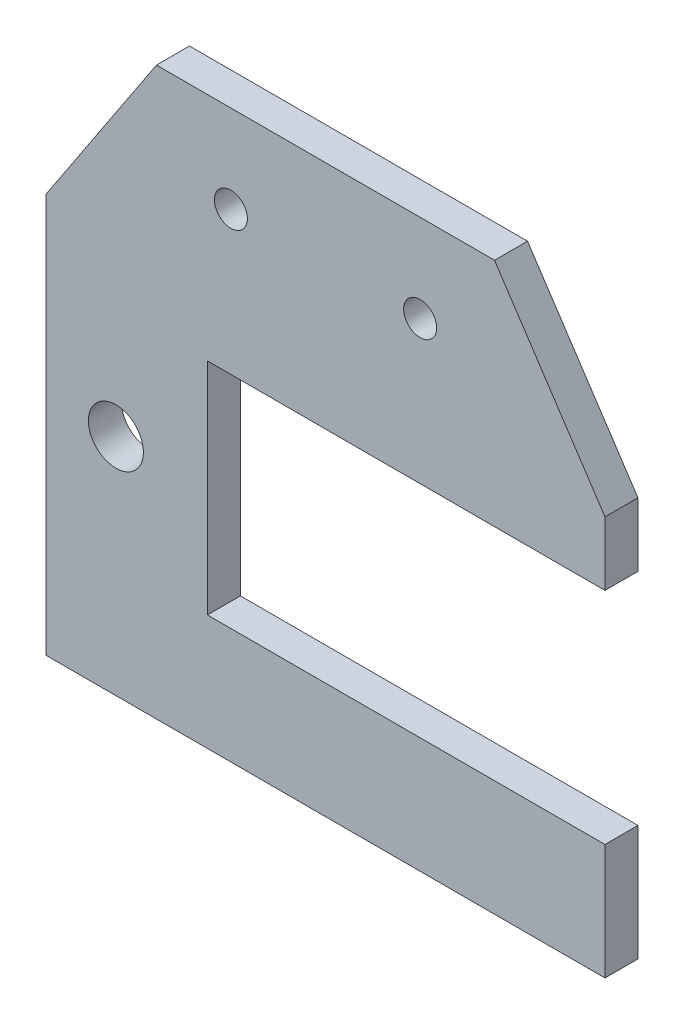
ISO-10303-21;
HEADER;
FILE_DESCRIPTION(('STEP AP214'),'2;1');
FILE_NAME('part.step','',(''),(''),'','','');
FILE_SCHEMA(('AUTOMOTIVE_DESIGN { 1 0 10303 214 1 1 1 1 }'));
ENDSEC;
DATA;
#1=APPLICATION_CONTEXT('core data for automotive mechanical design processes');
#2=APPLICATION_PROTOCOL_DEFINITION('international standard','automotive_design',2000,#1);
#3=PRODUCT_CONTEXT('',#1,'mechanical');
#4=PRODUCT('Part','Part','',(#3));
#5=PRODUCT_RELATED_PRODUCT_CATEGORY('part','',(#4));
#6=PRODUCT_DEFINITION_FORMATION('','',#4);
#7=PRODUCT_DEFINITION_CONTEXT('part definition',#1,'design');
#8=PRODUCT_DEFINITION('design','',#6,#7);
#9=PRODUCT_DEFINITION_SHAPE('','',#8);
#10=(LENGTH_UNIT() NAMED_UNIT(*) SI_UNIT(.MILLI.,.METRE.));
#11=(NAMED_UNIT(*) PLANE_ANGLE_UNIT() SI_UNIT($,.RADIAN.));
#12=(NAMED_UNIT(*) SI_UNIT($,.STERADIAN.) SOLID_ANGLE_UNIT());
#13=UNCERTAINTY_MEASURE_WITH_UNIT(LENGTH_MEASURE(1.E-05),#10,'distance_accuracy_value','');
#14=(GEOMETRIC_REPRESENTATION_CONTEXT(3) GLOBAL_UNCERTAINTY_ASSIGNED_CONTEXT((#13)) GLOBAL_UNIT_ASSIGNED_CONTEXT((#10,
#11,#12)) REPRESENTATION_CONTEXT('',''));
#15=CARTESIAN_POINT('',(0.,0.,0.));
#16=DIRECTION('',(0.,0.,1.));
#17=DIRECTION('',(1.,0.,0.));
#18=AXIS2_PLACEMENT_3D('',#15,#16,#17);
#19=CARTESIAN_POINT('',(0.,-1.81128409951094,3.));
#20=DIRECTION('',(0.,1.,0.));
#21=DIRECTION('',(-1.,0.,0.));
#22=AXIS2_PLACEMENT_3D('',#19,#20,#21);
#23=PLANE('',#22);
#24=DIRECTION('',(1.,0.,0.));
#25=VECTOR('',#24,1.);
#26=CARTESIAN_POINT('',(0.,-1.81128409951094,0.));
#27=LINE('',#26,#25);
#28=CARTESIAN_POINT('',(-10.7376947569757,-1.81128409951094,0.));
#29=VERTEX_POINT('',#28);
#30=CARTESIAN_POINT('',(25.4023052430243,-1.81128409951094,0.));
#31=VERTEX_POINT('',#30);
#32=EDGE_CURVE('E181',#29,#31,#27,.T.);
#33=ORIENTED_EDGE('',*,*,#32,.F.);
#34=DIRECTION('',(0.,0.,-1.));
#35=VECTOR('',#34,1.);
#36=CARTESIAN_POINT('',(-10.7376947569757,-1.81128409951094,3.));
#37=LINE('',#36,#35);
#38=CARTESIAN_POINT('',(-10.7376947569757,-1.81128409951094,3.));
#39=VERTEX_POINT('',#38);
#40=EDGE_CURVE('E11',#39,#29,#37,.T.);
#41=ORIENTED_EDGE('',*,*,#40,.F.);
#42=DIRECTION('',(1.,0.,0.));
#43=VECTOR('',#42,1.);
#44=CARTESIAN_POINT('',(0.,-1.81128409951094,3.));
#45=LINE('',#44,#43);
#46=CARTESIAN_POINT('',(25.4023052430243,-1.81128409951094,3.));
#47=VERTEX_POINT('',#46);
#48=EDGE_CURVE('E273',#39,#47,#45,.T.);
#49=ORIENTED_EDGE('',*,*,#48,.T.);
#50=DIRECTION('',(0.,0.,-1.));
#51=VECTOR('',#50,1.);
#52=CARTESIAN_POINT('',(25.4023052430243,-1.81128409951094,3.));
#53=LINE('',#52,#51);
#54=EDGE_CURVE('E60',#47,#31,#53,.T.);
#55=ORIENTED_EDGE('',*,*,#54,.T.);
#56=EDGE_LOOP('',(#33,#41,#49,#55));
#57=FACE_BOUND('',#56,.T.);
#58=ADVANCED_FACE('F43',(#57),#23,.T.);
#59=CARTESIAN_POINT('',(-10.7376947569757,0.,3.));
#60=DIRECTION('',(1.,0.,0.));
#61=DIRECTION('',(0.,1.,0.));
#62=AXIS2_PLACEMENT_3D('',#59,#60,#61);
#63=PLANE('',#62);
#64=DIRECTION('',(0.,-1.,0.));
#65=VECTOR('',#64,1.);
#66=CARTESIAN_POINT('',(-10.7376947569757,0.,0.));
#67=LINE('',#66,#65);
#68=CARTESIAN_POINT('',(-10.7376947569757,18.1887159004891,0.));
#69=VERTEX_POINT('',#68);
#70=EDGE_CURVE('E175',#69,#29,#67,.T.);
#71=ORIENTED_EDGE('',*,*,#70,.F.);
#72=DIRECTION('',(0.,0.,-1.));
#73=VECTOR('',#72,1.);
#74=CARTESIAN_POINT('',(-10.7376947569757,18.1887159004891,3.));
#75=LINE('',#74,#73);
#76=CARTESIAN_POINT('',(-10.7376947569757,18.1887159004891,3.));
#77=VERTEX_POINT('',#76);
#78=EDGE_CURVE('E52',#77,#69,#75,.T.);
#79=ORIENTED_EDGE('',*,*,#78,.F.);
#80=DIRECTION('',(0.,-1.,0.));
#81=VECTOR('',#80,1.);
#82=CARTESIAN_POINT('',(-10.7376947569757,0.,3.));
#83=LINE('',#82,#81);
#84=EDGE_CURVE('E275',#77,#39,#83,.T.);
#85=ORIENTED_EDGE('',*,*,#84,.T.);
#86=ORIENTED_EDGE('',*,*,#40,.T.);
#87=EDGE_LOOP('',(#71,#79,#85,#86));
#88=FACE_BOUND('',#87,.T.);
#89=ADVANCED_FACE('F180',(#88),#63,.T.);
#90=CARTESIAN_POINT('',(0.,18.1887159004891,3.));
#91=DIRECTION('',(0.,1.,0.));
#92=DIRECTION('',(-1.,0.,0.));
#93=AXIS2_PLACEMENT_3D('',#90,#91,#92);
#94=PLANE('',#93);
#95=DIRECTION('',(1.,0.,0.));
#96=VECTOR('',#95,1.);
#97=CARTESIAN_POINT('',(0.,18.1887159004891,0.));
#98=LINE('',#97,#96);
#99=CARTESIAN_POINT('',(25.4023052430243,18.1887159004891,0.));
#100=VERTEX_POINT('',#99);
#101=EDGE_CURVE('E164',#69,#100,#98,.T.);
#102=ORIENTED_EDGE('',*,*,#101,.T.);
#103=DIRECTION('',(0.,0.,-1.));
#104=VECTOR('',#103,1.);
#105=CARTESIAN_POINT('',(25.4023052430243,18.1887159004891,3.));
#106=LINE('',#105,#104);
#107=CARTESIAN_POINT('',(25.4023052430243,18.1887159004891,3.));
#108=VERTEX_POINT('',#107);
#109=EDGE_CURVE('E157',#108,#100,#106,.T.);
#110=ORIENTED_EDGE('',*,*,#109,.F.);
#111=DIRECTION('',(1.,0.,0.));
#112=VECTOR('',#111,1.);
#113=CARTESIAN_POINT('',(0.,18.1887159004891,3.));
#114=LINE('',#113,#112);
#115=EDGE_CURVE('E166',#77,#108,#114,.T.);
#116=ORIENTED_EDGE('',*,*,#115,.F.);
#117=ORIENTED_EDGE('',*,*,#78,.T.);
#118=EDGE_LOOP('',(#102,#110,#116,#117));
#119=FACE_BOUND('',#118,.T.);
#120=ADVANCED_FACE('F162',(#119),#94,.F.);
#121=CARTESIAN_POINT('',(25.4023052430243,0.,3.));
#122=DIRECTION('',(1.,0.,0.));
#123=DIRECTION('',(0.,1.,0.));
#124=AXIS2_PLACEMENT_3D('',#121,#122,#123);
#125=PLANE('',#124);
#126=DIRECTION('',(0.,-1.,0.));
#127=VECTOR('',#126,1.);
#128=CARTESIAN_POINT('',(25.4023052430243,0.,0.));
#129=LINE('',#128,#127);
#130=CARTESIAN_POINT('',(25.4023052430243,23.9787159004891,0.));
#131=VERTEX_POINT('',#130);
#132=EDGE_CURVE('E178',#131,#100,#129,.T.);
#133=ORIENTED_EDGE('',*,*,#132,.F.);
#134=DIRECTION('',(0.,0.,-1.));
#135=VECTOR('',#134,1.);
#136=CARTESIAN_POINT('',(25.4023052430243,23.9787159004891,3.));
#137=LINE('',#136,#135);
#138=CARTESIAN_POINT('',(25.4023052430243,23.9787159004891,3.));
#139=VERTEX_POINT('',#138);
#140=EDGE_CURVE('E155',#139,#131,#137,.T.);
#141=ORIENTED_EDGE('',*,*,#140,.F.);
#142=DIRECTION('',(0.,-1.,0.));
#143=VECTOR('',#142,1.);
#144=CARTESIAN_POINT('',(25.4023052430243,0.,3.));
#145=LINE('',#144,#143);
#146=EDGE_CURVE('E281',#139,#108,#145,.T.);
#147=ORIENTED_EDGE('',*,*,#146,.T.);
#148=ORIENTED_EDGE('',*,*,#109,.T.);
#149=EDGE_LOOP('',(#133,#141,#147,#148));
#150=FACE_BOUND('',#149,.T.);
#151=ADVANCED_FACE('F239',(#150),#125,.T.);
#152=CARTESIAN_POINT('',(28.7074792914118,18.9794572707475,3.));
#153=DIRECTION('',(0.834174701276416,0.551500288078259,0.));
#154=DIRECTION('',(-0.551500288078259,0.834174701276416,0.));
#155=AXIS2_PLACEMENT_3D('',#152,#153,#154);
#156=PLANE('',#155);
#157=DIRECTION('',(0.551500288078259,-0.834174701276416,0.));
#158=VECTOR('',#157,1.);
#159=CARTESIAN_POINT('',(28.7074792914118,18.9794572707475,0.));
#160=LINE('',#159,#158);
#161=CARTESIAN_POINT('',(15.365,39.1606954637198,0.));
#162=VERTEX_POINT('',#161);
#163=EDGE_CURVE('E188',#162,#131,#160,.T.);
#164=ORIENTED_EDGE('',*,*,#163,.F.);
#165=DIRECTION('',(0.,0.,-1.));
#166=VECTOR('',#165,1.);
#167=CARTESIAN_POINT('',(15.365,39.1606954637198,3.));
#168=LINE('',#167,#166);
#169=CARTESIAN_POINT('',(15.365,39.1606954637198,3.));
#170=VERTEX_POINT('',#169);
#171=EDGE_CURVE('E153',#170,#162,#168,.T.);
#172=ORIENTED_EDGE('',*,*,#171,.F.);
#173=DIRECTION('',(0.551500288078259,-0.834174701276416,0.));
#174=VECTOR('',#173,1.);
#175=CARTESIAN_POINT('',(28.7074792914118,18.9794572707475,3.));
#176=LINE('',#175,#174);
#177=EDGE_CURVE('E284',#170,#139,#176,.T.);
#178=ORIENTED_EDGE('',*,*,#177,.T.);
#179=ORIENTED_EDGE('',*,*,#140,.T.);
#180=EDGE_LOOP('',(#164,#172,#178,#179));
#181=FACE_BOUND('',#180,.T.);
#182=ADVANCED_FACE('F242',(#181),#156,.T.);
#183=CARTESIAN_POINT('',(0.,39.1606954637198,3.));
#184=DIRECTION('',(0.,-1.,0.));
#185=DIRECTION('',(0.,0.,-1.));
#186=AXIS2_PLACEMENT_3D('',#183,#184,#185);
#187=PLANE('',#186);
#188=DIRECTION('',(-1.,0.,0.));
#189=VECTOR('',#188,1.);
#190=CARTESIAN_POINT('',(0.,39.1606954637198,0.));
#191=LINE('',#190,#189);
#192=CARTESIAN_POINT('',(-15.365,39.1606954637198,0.));
#193=VERTEX_POINT('',#192);
#194=EDGE_CURVE('E190',#162,#193,#191,.T.);
#195=ORIENTED_EDGE('',*,*,#194,.T.);
#196=DIRECTION('',(0.,0.,-1.));
#197=VECTOR('',#196,1.);
#198=CARTESIAN_POINT('',(-15.365,39.1606954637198,3.));
#199=LINE('',#198,#197);
#200=CARTESIAN_POINT('',(-15.365,39.1606954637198,3.));
#201=VERTEX_POINT('',#200);
#202=EDGE_CURVE('E146',#201,#193,#199,.T.);
#203=ORIENTED_EDGE('',*,*,#202,.F.);
#204=DIRECTION('',(-1.,0.,0.));
#205=VECTOR('',#204,1.);
#206=CARTESIAN_POINT('',(0.,39.1606954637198,3.));
#207=LINE('',#206,#205);
#208=EDGE_CURVE('E287',#170,#201,#207,.T.);
#209=ORIENTED_EDGE('',*,*,#208,.F.);
#210=ORIENTED_EDGE('',*,*,#171,.T.);
#211=EDGE_LOOP('',(#195,#203,#209,#210));
#212=FACE_BOUND('',#211,.T.);
#213=ADVANCED_FACE('F246',(#212),#187,.F.);
#214=CARTESIAN_POINT('',(-28.7074792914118,18.9794572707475,3.));
#215=DIRECTION('',(0.834174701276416,-0.551500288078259,0.));
#216=DIRECTION('',(0.551500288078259,0.834174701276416,0.));
#217=AXIS2_PLACEMENT_3D('',#214,#215,#216);
#218=PLANE('',#217);
#219=DIRECTION('',(-0.551500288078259,-0.834174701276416,0.));
#220=VECTOR('',#219,1.);
#221=CARTESIAN_POINT('',(-28.7074792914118,18.9794572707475,0.));
#222=LINE('',#221,#220);
#223=CARTESIAN_POINT('',(-25.4023052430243,23.9787159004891,0.));
#224=VERTEX_POINT('',#223);
#225=EDGE_CURVE('E193',#193,#224,#222,.T.);
#226=ORIENTED_EDGE('',*,*,#225,.T.);
#227=DIRECTION('',(0.,0.,-1.));
#228=VECTOR('',#227,1.);
#229=CARTESIAN_POINT('',(-25.4023052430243,23.9787159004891,3.));
#230=LINE('',#229,#228);
#231=CARTESIAN_POINT('',(-25.4023052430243,23.9787159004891,3.));
#232=VERTEX_POINT('',#231);
#233=EDGE_CURVE('E144',#232,#224,#230,.T.);
#234=ORIENTED_EDGE('',*,*,#233,.F.);
#235=DIRECTION('',(-0.551500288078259,-0.834174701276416,0.));
#236=VECTOR('',#235,1.);
#237=CARTESIAN_POINT('',(-28.7074792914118,18.9794572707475,3.));
#238=LINE('',#237,#236);
#239=EDGE_CURVE('E137',#201,#232,#238,.T.);
#240=ORIENTED_EDGE('',*,*,#239,.F.);
#241=ORIENTED_EDGE('',*,*,#202,.T.);
#242=EDGE_LOOP('',(#226,#234,#240,#241));
#243=FACE_BOUND('',#242,.T.);
#244=ADVANCED_FACE('F250',(#243),#218,.F.);
#245=CARTESIAN_POINT('',(-25.4023052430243,0.,3.));
#246=DIRECTION('',(1.,0.,0.));
#247=DIRECTION('',(0.,1.,0.));
#248=AXIS2_PLACEMENT_3D('',#245,#246,#247);
#249=PLANE('',#248);
#250=DIRECTION('',(0.,-1.,0.));
#251=VECTOR('',#250,1.);
#252=CARTESIAN_POINT('',(-25.4023052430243,0.,0.));
#253=LINE('',#252,#251);
#254=CARTESIAN_POINT('',(-25.4023052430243,-12.3212840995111,0.));
#255=VERTEX_POINT('',#254);
#256=EDGE_CURVE('E143',#224,#255,#253,.T.);
#257=ORIENTED_EDGE('',*,*,#256,.T.);
#258=DIRECTION('',(0.,0.,-1.));
#259=VECTOR('',#258,1.);
#260=CARTESIAN_POINT('',(-25.4023052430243,-12.3212840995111,3.));
#261=LINE('',#260,#259);
#262=CARTESIAN_POINT('',(-25.4023052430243,-12.3212840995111,3.));
#263=VERTEX_POINT('',#262);
#264=EDGE_CURVE('E126',#263,#255,#261,.T.);
#265=ORIENTED_EDGE('',*,*,#264,.F.);
#266=DIRECTION('',(0.,-1.,0.));
#267=VECTOR('',#266,1.);
#268=CARTESIAN_POINT('',(-25.4023052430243,0.,3.));
#269=LINE('',#268,#267);
#270=EDGE_CURVE('E131',#232,#263,#269,.T.);
#271=ORIENTED_EDGE('',*,*,#270,.F.);
#272=ORIENTED_EDGE('',*,*,#233,.T.);
#273=EDGE_LOOP('',(#257,#265,#271,#272));
#274=FACE_BOUND('',#273,.T.);
#275=ADVANCED_FACE('F142',(#274),#249,.F.);
#276=CARTESIAN_POINT('',(0.,-12.321284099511,3.));
#277=DIRECTION('',(0.,1.,0.));
#278=DIRECTION('',(-1.,0.,0.));
#279=AXIS2_PLACEMENT_3D('',#276,#277,#278);
#280=PLANE('',#279);
#281=DIRECTION('',(1.,0.,0.));
#282=VECTOR('',#281,1.);
#283=CARTESIAN_POINT('',(0.,-12.321284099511,0.));
#284=LINE('',#283,#282);
#285=CARTESIAN_POINT('',(25.4023052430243,-12.3212840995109,0.));
#286=VERTEX_POINT('',#285);
#287=EDGE_CURVE('E197',#255,#286,#284,.T.);
#288=ORIENTED_EDGE('',*,*,#287,.T.);
#289=DIRECTION('',(0.,0.,-1.));
#290=VECTOR('',#289,1.);
#291=CARTESIAN_POINT('',(25.4023052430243,-12.3212840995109,3.));
#292=LINE('',#291,#290);
#293=CARTESIAN_POINT('',(25.4023052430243,-12.3212840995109,3.));
#294=VERTEX_POINT('',#293);
#295=EDGE_CURVE('E92',#294,#286,#292,.T.);
#296=ORIENTED_EDGE('',*,*,#295,.F.);
#297=DIRECTION('',(1.,0.,0.));
#298=VECTOR('',#297,1.);
#299=CARTESIAN_POINT('',(0.,-12.321284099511,3.));
#300=LINE('',#299,#298);
#301=EDGE_CURVE('E122',#263,#294,#300,.T.);
#302=ORIENTED_EDGE('',*,*,#301,.F.);
#303=ORIENTED_EDGE('',*,*,#264,.T.);
#304=EDGE_LOOP('',(#288,#296,#302,#303));
#305=FACE_BOUND('',#304,.T.);
#306=ADVANCED_FACE('F124',(#305),#280,.F.);
#307=CARTESIAN_POINT('',(25.4023052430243,0.,3.));
#308=DIRECTION('',(1.,0.,0.));
#309=DIRECTION('',(0.,1.,0.));
#310=AXIS2_PLACEMENT_3D('',#307,#308,#309);
#311=PLANE('',#310);
#312=DIRECTION('',(0.,-1.,0.));
#313=VECTOR('',#312,1.);
#314=CARTESIAN_POINT('',(25.4023052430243,0.,0.));
#315=LINE('',#314,#313);
#316=EDGE_CURVE('E199',#31,#286,#315,.T.);
#317=ORIENTED_EDGE('',*,*,#316,.F.);
#318=ORIENTED_EDGE('',*,*,#54,.F.);
#319=DIRECTION('',(0.,-1.,0.));
#320=VECTOR('',#319,1.);
#321=CARTESIAN_POINT('',(25.4023052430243,0.,3.));
#322=LINE('',#321,#320);
#323=EDGE_CURVE('E130',#47,#294,#322,.T.);
#324=ORIENTED_EDGE('',*,*,#323,.T.);
#325=ORIENTED_EDGE('',*,*,#295,.T.);
#326=EDGE_LOOP('',(#317,#318,#324,#325));
#327=FACE_BOUND('',#326,.T.);
#328=ADVANCED_FACE('F220',(#327),#311,.T.);
#329=CARTESIAN_POINT('',(-19.0523052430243,8.07871590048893,3.));
#330=DIRECTION('',(0.,0.,-1.));
#331=DIRECTION('',(-1.,0.,0.));
#332=AXIS2_PLACEMENT_3D('',#329,#330,#331);
#333=CYLINDRICAL_SURFACE('',#332,2.5);
#334=CARTESIAN_POINT('',(-19.0523052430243,8.07871590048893,3.));
#335=DIRECTION('',(0.,0.,1.));
#336=DIRECTION('',(1.,0.,0.));
#337=AXIS2_PLACEMENT_3D('',#334,#335,#336);
#338=CIRCLE('',#337,2.5);
#339=CARTESIAN_POINT('',(-16.5523052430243,8.07871590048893,3.));
#340=VERTEX_POINT('',#339);
#341=EDGE_CURVE('E272',#340,#340,#338,.T.);
#342=ORIENTED_EDGE('',*,*,#341,.T.);
#343=EDGE_LOOP('',(#342));
#344=FACE_BOUND('',#343,.T.);
#345=CARTESIAN_POINT('',(-19.0523052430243,8.07871590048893,0.));
#346=DIRECTION('',(0.,0.,1.));
#347=DIRECTION('',(1.,0.,0.));
#348=AXIS2_PLACEMENT_3D('',#345,#346,#347);
#349=CIRCLE('',#348,2.5);
#350=CARTESIAN_POINT('',(-16.5523052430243,8.07871590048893,0.));
#351=VERTEX_POINT('',#350);
#352=EDGE_CURVE('E183',#351,#351,#349,.T.);
#353=ORIENTED_EDGE('',*,*,#352,.F.);
#354=EDGE_LOOP('',(#353));
#355=FACE_BOUND('',#354,.T.);
#356=ADVANCED_FACE('F218',(#344,#355),#333,.F.);
#357=CARTESIAN_POINT('',(-8.60230524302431,31.1906954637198,3.));
#358=DIRECTION('',(0.,0.,-1.));
#359=DIRECTION('',(-1.,0.,0.));
#360=AXIS2_PLACEMENT_3D('',#357,#358,#359);
#361=CYLINDRICAL_SURFACE('',#360,1.5);
#362=CARTESIAN_POINT('',(-8.60230524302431,31.1906954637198,3.));
#363=DIRECTION('',(0.,0.,1.));
#364=DIRECTION('',(1.,0.,0.));
#365=AXIS2_PLACEMENT_3D('',#362,#363,#364);
#366=CIRCLE('',#365,1.5);
#367=CARTESIAN_POINT('',(-7.10230524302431,31.1906954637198,3.));
#368=VERTEX_POINT('',#367);
#369=EDGE_CURVE('E204',#368,#368,#366,.T.);
#370=ORIENTED_EDGE('',*,*,#369,.T.);
#371=EDGE_LOOP('',(#370));
#372=FACE_BOUND('',#371,.T.);
#373=CARTESIAN_POINT('',(-8.60230524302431,31.1906954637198,0.));
#374=DIRECTION('',(0.,0.,1.));
#375=DIRECTION('',(1.,0.,0.));
#376=AXIS2_PLACEMENT_3D('',#373,#374,#375);
#377=CIRCLE('',#376,1.5);
#378=CARTESIAN_POINT('',(-7.10230524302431,31.1906954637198,0.));
#379=VERTEX_POINT('',#378);
#380=EDGE_CURVE('E212',#379,#379,#377,.T.);
#381=ORIENTED_EDGE('',*,*,#380,.F.);
#382=EDGE_LOOP('',(#381));
#383=FACE_BOUND('',#382,.T.);
#384=ADVANCED_FACE('F45',(#372,#383),#361,.F.);
#385=CARTESIAN_POINT('',(8.60230524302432,31.1906954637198,3.));
#386=DIRECTION('',(0.,0.,-1.));
#387=DIRECTION('',(-1.,0.,0.));
#388=AXIS2_PLACEMENT_3D('',#385,#386,#387);
#389=CYLINDRICAL_SURFACE('',#388,1.5);
#390=CARTESIAN_POINT('',(8.60230524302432,31.1906954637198,3.));
#391=DIRECTION('',(0.,0.,1.));
#392=DIRECTION('',(1.,0.,0.));
#393=AXIS2_PLACEMENT_3D('',#390,#391,#392);
#394=CIRCLE('',#393,1.5);
#395=CARTESIAN_POINT('',(10.1023052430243,31.1906954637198,3.));
#396=VERTEX_POINT('',#395);
#397=EDGE_CURVE('E205',#396,#396,#394,.T.);
#398=ORIENTED_EDGE('',*,*,#397,.T.);
#399=EDGE_LOOP('',(#398));
#400=FACE_BOUND('',#399,.T.);
#401=CARTESIAN_POINT('',(8.60230524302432,31.1906954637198,0.));
#402=DIRECTION('',(0.,0.,1.));
#403=DIRECTION('',(1.,0.,0.));
#404=AXIS2_PLACEMENT_3D('',#401,#402,#403);
#405=CIRCLE('',#404,1.5);
#406=CARTESIAN_POINT('',(10.1023052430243,31.1906954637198,0.));
#407=VERTEX_POINT('',#406);
#408=EDGE_CURVE('E202',#407,#407,#405,.T.);
#409=ORIENTED_EDGE('',*,*,#408,.F.);
#410=EDGE_LOOP('',(#409));
#411=FACE_BOUND('',#410,.T.);
#412=ADVANCED_FACE('F226',(#400,#411),#389,.F.);
#413=CARTESIAN_POINT('',(0.,0.,3.));
#414=DIRECTION('',(0.,0.,1.));
#415=DIRECTION('',(1.,0.,0.));
#416=AXIS2_PLACEMENT_3D('',#413,#414,#415);
#417=PLANE('',#416);
#418=ORIENTED_EDGE('',*,*,#369,.F.);
#419=EDGE_LOOP('',(#418));
#420=FACE_BOUND('',#419,.T.);
#421=ORIENTED_EDGE('',*,*,#341,.F.);
#422=EDGE_LOOP('',(#421));
#423=FACE_BOUND('',#422,.T.);
#424=ORIENTED_EDGE('',*,*,#48,.F.);
#425=ORIENTED_EDGE('',*,*,#84,.F.);
#426=ORIENTED_EDGE('',*,*,#115,.T.);
#427=ORIENTED_EDGE('',*,*,#146,.F.);
#428=ORIENTED_EDGE('',*,*,#177,.F.);
#429=ORIENTED_EDGE('',*,*,#208,.T.);
#430=ORIENTED_EDGE('',*,*,#239,.T.);
#431=ORIENTED_EDGE('',*,*,#270,.T.);
#432=ORIENTED_EDGE('',*,*,#301,.T.);
#433=ORIENTED_EDGE('',*,*,#323,.F.);
#434=EDGE_LOOP('',(#424,#425,#426,#427,#428,#429,#430,#431,#432,#433));
#435=FACE_BOUND('',#434,.T.);
#436=ORIENTED_EDGE('',*,*,#397,.F.);
#437=EDGE_LOOP('',(#436));
#438=FACE_BOUND('',#437,.T.);
#439=ADVANCED_FACE('F134',(#420,#423,#435,#438),#417,.T.);
#440=CARTESIAN_POINT('',(0.,0.,0.));
#441=DIRECTION('',(0.,0.,1.));
#442=DIRECTION('',(1.,0.,0.));
#443=AXIS2_PLACEMENT_3D('',#440,#441,#442);
#444=PLANE('',#443);
#445=ORIENTED_EDGE('',*,*,#380,.T.);
#446=EDGE_LOOP('',(#445));
#447=FACE_BOUND('',#446,.T.);
#448=ORIENTED_EDGE('',*,*,#352,.T.);
#449=EDGE_LOOP('',(#448));
#450=FACE_BOUND('',#449,.T.);
#451=ORIENTED_EDGE('',*,*,#32,.T.);
#452=ORIENTED_EDGE('',*,*,#316,.T.);
#453=ORIENTED_EDGE('',*,*,#287,.F.);
#454=ORIENTED_EDGE('',*,*,#256,.F.);
#455=ORIENTED_EDGE('',*,*,#225,.F.);
#456=ORIENTED_EDGE('',*,*,#194,.F.);
#457=ORIENTED_EDGE('',*,*,#163,.T.);
#458=ORIENTED_EDGE('',*,*,#132,.T.);
#459=ORIENTED_EDGE('',*,*,#101,.F.);
#460=ORIENTED_EDGE('',*,*,#70,.T.);
#461=EDGE_LOOP('',(#451,#452,#453,#454,#455,#456,#457,#458,#459,#460));
#462=FACE_BOUND('',#461,.T.);
#463=ORIENTED_EDGE('',*,*,#408,.T.);
#464=EDGE_LOOP('',(#463));
#465=FACE_BOUND('',#464,.T.);
#466=ADVANCED_FACE('F173',(#447,#450,#462,#465),#444,.F.);
#467=CLOSED_SHELL('',(#58,#89,#120,#151,#182,#213,#244,#275,#306,#328,#356,#384,#412,#439,#466));
#468=MANIFOLD_SOLID_BREP('B2',#467);
#469=ADVANCED_BREP_SHAPE_REPRESENTATION('',(#18,#468),#14);
#470=SHAPE_DEFINITION_REPRESENTATION(#9,#469);
ENDSEC;
END-ISO-10303-21;
